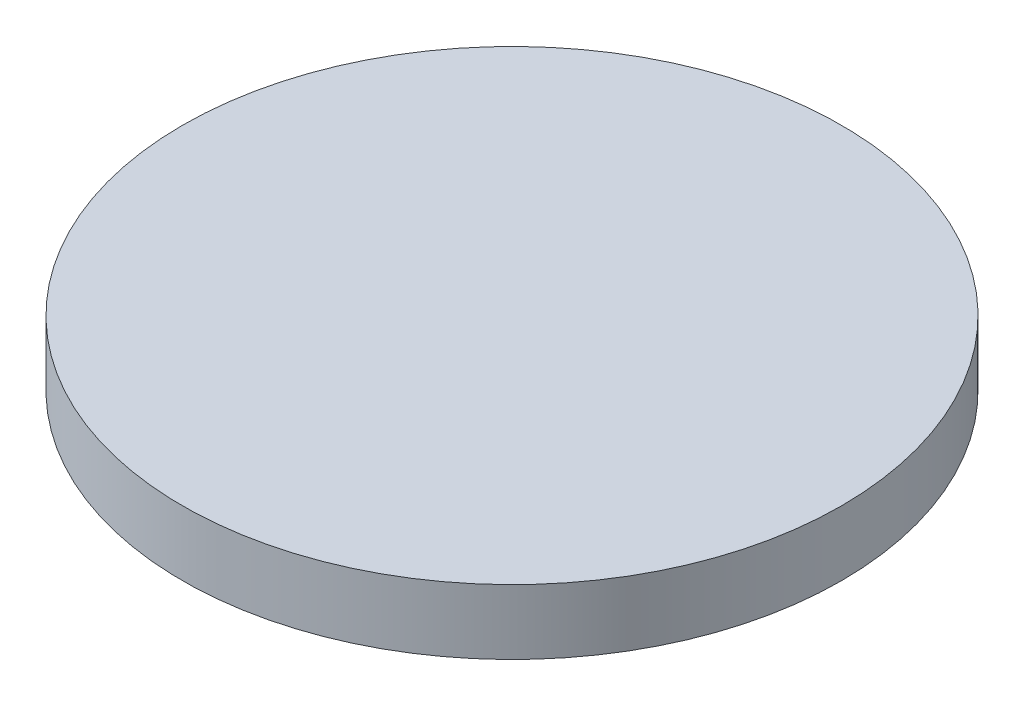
ISO-10303-21;
HEADER;
FILE_DESCRIPTION(('STEP AP214'),'2;1');
FILE_NAME('part.step','',(''),(''),'','','');
FILE_SCHEMA(('AUTOMOTIVE_DESIGN { 1 0 10303 214 1 1 1 1 }'));
ENDSEC;
DATA;
#1=APPLICATION_CONTEXT('core data for automotive mechanical design processes');
#2=APPLICATION_PROTOCOL_DEFINITION('international standard','automotive_design',2000,#1);
#3=PRODUCT_CONTEXT('',#1,'mechanical');
#4=PRODUCT('Part','Part','',(#3));
#5=PRODUCT_RELATED_PRODUCT_CATEGORY('part','',(#4));
#6=PRODUCT_DEFINITION_FORMATION('','',#4);
#7=PRODUCT_DEFINITION_CONTEXT('part definition',#1,'design');
#8=PRODUCT_DEFINITION('design','',#6,#7);
#9=PRODUCT_DEFINITION_SHAPE('','',#8);
#10=(LENGTH_UNIT() NAMED_UNIT(*) SI_UNIT(.MILLI.,.METRE.));
#11=(NAMED_UNIT(*) PLANE_ANGLE_UNIT() SI_UNIT($,.RADIAN.));
#12=(NAMED_UNIT(*) SI_UNIT($,.STERADIAN.) SOLID_ANGLE_UNIT());
#13=UNCERTAINTY_MEASURE_WITH_UNIT(LENGTH_MEASURE(1.E-05),#10,'distance_accuracy_value','');
#14=(GEOMETRIC_REPRESENTATION_CONTEXT(3) GLOBAL_UNCERTAINTY_ASSIGNED_CONTEXT((#13)) GLOBAL_UNIT_ASSIGNED_CONTEXT((#10,
#11,#12)) REPRESENTATION_CONTEXT('',''));
#15=CARTESIAN_POINT('',(0.,0.,0.));
#16=DIRECTION('',(0.,0.,1.));
#17=DIRECTION('',(1.,0.,0.));
#18=AXIS2_PLACEMENT_3D('',#15,#16,#17);
#19=CARTESIAN_POINT('',(2.13517525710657E-13,0.,0.));
#20=CARTESIAN_POINT('',(0.190853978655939,0.,0.));
#21=CARTESIAN_POINT('',(0.57275234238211,0.00102651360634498,0.));
#22=CARTESIAN_POINT('',(1.48383479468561,0.00564453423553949,0.));
#23=CARTESIAN_POINT('',(2.22253196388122,0.0179368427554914,0.));
#24=CARTESIAN_POINT('',(3.24297162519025,0.0362650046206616,0.));
#25=CARTESIAN_POINT('',(4.0945615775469,0.0605819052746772,0.));
#26=CARTESIAN_POINT('',(5.04766715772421,0.090659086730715,0.));
#27=CARTESIAN_POINT('',(5.93943443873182,0.126492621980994,0.));
#28=CARTESIAN_POINT('',(6.86715969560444,0.167632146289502,0.));
#29=CARTESIAN_POINT('',(7.77420946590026,0.214298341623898,0.));
#30=CARTESIAN_POINT('',(8.69081929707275,0.26555089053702,0.));
#31=CARTESIAN_POINT('',(9.60539937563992,0.322308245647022,0.));
#32=CARTESIAN_POINT('',(10.5139128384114,0.382414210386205,0.));
#33=CARTESIAN_POINT('',(11.43631593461,0.448638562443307,0.));
#34=CARTESIAN_POINT('',(12.5220400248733,0.530170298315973,0.));
#35=CARTESIAN_POINT('',(13.8870676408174,0.641631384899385,0.));
#36=CARTESIAN_POINT('',(15.3810220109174,0.769879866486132,0.));
#37=CARTESIAN_POINT('',(17.2658563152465,0.946586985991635,0.));
#38=CARTESIAN_POINT('',(18.9356880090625,1.10851802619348,0.));
#39=CARTESIAN_POINT('',(20.9983212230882,1.32084601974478,0.));
#40=CARTESIAN_POINT('',(22.4246133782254,1.46943679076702,0.));
#41=CARTESIAN_POINT('',(24.2757481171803,1.66941872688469,0.));
#42=CARTESIAN_POINT('',(25.0205482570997,1.75031301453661,0.));
#43=CARTESIAN_POINT('',(25.4000000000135,1.79175382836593,0.));
#44=B_SPLINE_CURVE_WITH_KNOTS('',4,(#19,#20,#21,#22,#23,#24,#25,#26,#27,#28,#29,#30,#31,#32,#33,
#34,#35,#36,#37,#38,#39,#40,#41,#42,#43),.UNSPECIFIED.,.F.,.F.,(5,1,1,1,1,1,1,1,1,1,1,1,1,1,1,1,
1,1,1,1,1,5),(0.0831566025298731,0.113122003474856,0.1430874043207,0.173052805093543,
0.203018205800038,0.23298360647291,0.262949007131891,0.292914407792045,0.322879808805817,
0.352845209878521,0.382810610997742,0.412776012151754,0.442741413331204,0.472706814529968,
0.502672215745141,0.557596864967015,0.617527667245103,0.677458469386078,0.737389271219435,
0.797320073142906,0.857250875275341,0.917181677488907),.UNSPECIFIED.);
#45=CARTESIAN_POINT('',(2.1163626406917E-13,6.79175382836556,0.));
#46=DIRECTION('',(0.,1.,0.));
#47=AXIS1_PLACEMENT('',#45,#46);
#48=SURFACE_OF_REVOLUTION('',#44,#47);
#49=CARTESIAN_POINT('',(0.,1.7917538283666,0.));
#50=DIRECTION('',(0.,1.,0.));
#51=DIRECTION('',(-1.,0.,0.));
#52=AXIS2_PLACEMENT_3D('',#49,#50,#51);
#53=CIRCLE('',#52,25.4000000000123);
#54=CARTESIAN_POINT('',(-25.4000000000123,1.79175382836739,0.));
#55=VERTEX_POINT('',#54);
#56=EDGE_CURVE('E52',#55,#55,#53,.T.);
#57=ORIENTED_EDGE('',*,*,#56,.F.);
#58=EDGE_LOOP('',(#57));
#59=FACE_BOUND('',#58,.T.);
#60=CARTESIAN_POINT('',(0.,0.,0.));
#61=VERTEX_POINT('',#60);
#62=VERTEX_LOOP('',#61);
#63=FACE_BOUND('',#62,.T.);
#64=ADVANCED_FACE('F44',(#59,#63),#48,.T.);
#65=CARTESIAN_POINT('',(25.4000000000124,6.79175382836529,0.));
#66=DIRECTION('',(0.,-1.,0.));
#67=DIRECTION('',(1.,0.,0.));
#68=AXIS2_PLACEMENT_3D('',#65,#66,#67);
#69=PLANE('',#68);
#70=CARTESIAN_POINT('',(2.11636264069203E-13,6.7917538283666,0.));
#71=DIRECTION('',(0.,1.,0.));
#72=DIRECTION('',(-1.,0.,0.));
#73=AXIS2_PLACEMENT_3D('',#70,#71,#72);
#74=CIRCLE('',#73,25.4000000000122);
#75=CARTESIAN_POINT('',(-25.4000000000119,6.79175382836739,0.));
#76=VERTEX_POINT('',#75);
#77=EDGE_CURVE('E11',#76,#76,#74,.T.);
#78=ORIENTED_EDGE('',*,*,#77,.T.);
#79=EDGE_LOOP('',(#78));
#80=FACE_BOUND('',#79,.T.);
#81=ADVANCED_FACE('F60',(#80),#69,.F.);
#82=CARTESIAN_POINT('',(2.1163626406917E-13,6.79175382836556,0.));
#83=DIRECTION('',(0.,1.,0.));
#84=DIRECTION('',(-1.,0.,0.));
#85=AXIS2_PLACEMENT_3D('',#82,#83,#84);
#86=CYLINDRICAL_SURFACE('',#85,25.4000000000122);
#87=ORIENTED_EDGE('',*,*,#77,.F.);
#88=EDGE_LOOP('',(#87));
#89=FACE_BOUND('',#88,.T.);
#90=ORIENTED_EDGE('',*,*,#56,.T.);
#91=EDGE_LOOP('',(#90));
#92=FACE_BOUND('',#91,.T.);
#93=ADVANCED_FACE('F65',(#89,#92),#86,.T.);
#94=CLOSED_SHELL('',(#64,#81,#93));
#95=MANIFOLD_SOLID_BREP('B2',#94);
#96=ADVANCED_BREP_SHAPE_REPRESENTATION('',(#18,#95),#14);
#97=SHAPE_DEFINITION_REPRESENTATION(#9,#96);
ENDSEC;
END-ISO-10303-21;
